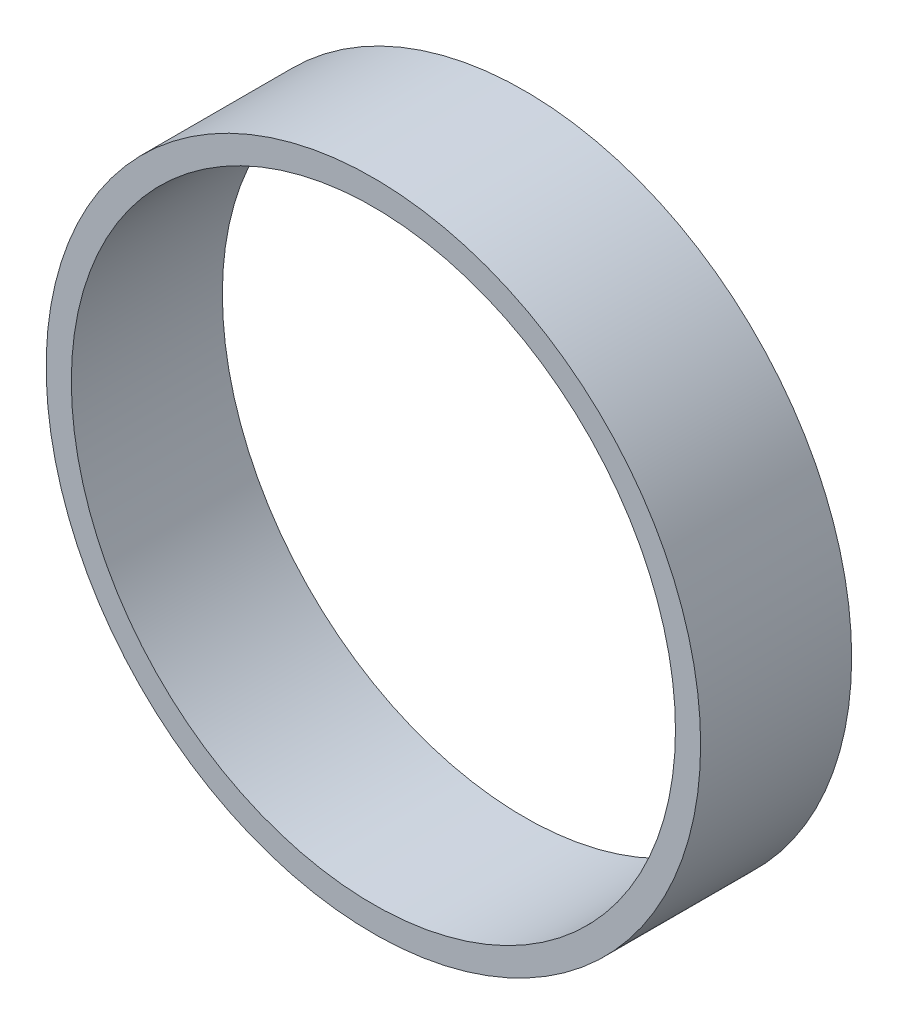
ISO-10303-21;
HEADER;
FILE_DESCRIPTION(('STEP AP214'),'2;1');
FILE_NAME('part.step','',(''),(''),'','','');
FILE_SCHEMA(('AUTOMOTIVE_DESIGN { 1 0 10303 214 1 1 1 1 }'));
ENDSEC;
DATA;
#1=APPLICATION_CONTEXT('core data for automotive mechanical design processes');
#2=APPLICATION_PROTOCOL_DEFINITION('international standard','automotive_design',2000,#1);
#3=PRODUCT_CONTEXT('',#1,'mechanical');
#4=PRODUCT('Part','Part','',(#3));
#5=PRODUCT_RELATED_PRODUCT_CATEGORY('part','',(#4));
#6=PRODUCT_DEFINITION_FORMATION('','',#4);
#7=PRODUCT_DEFINITION_CONTEXT('part definition',#1,'design');
#8=PRODUCT_DEFINITION('design','',#6,#7);
#9=PRODUCT_DEFINITION_SHAPE('','',#8);
#10=(LENGTH_UNIT() NAMED_UNIT(*) SI_UNIT(.MILLI.,.METRE.));
#11=(NAMED_UNIT(*) PLANE_ANGLE_UNIT() SI_UNIT($,.RADIAN.));
#12=(NAMED_UNIT(*) SI_UNIT($,.STERADIAN.) SOLID_ANGLE_UNIT());
#13=UNCERTAINTY_MEASURE_WITH_UNIT(LENGTH_MEASURE(1.E-05),#10,'distance_accuracy_value','');
#14=(GEOMETRIC_REPRESENTATION_CONTEXT(3) GLOBAL_UNCERTAINTY_ASSIGNED_CONTEXT((#13)) GLOBAL_UNIT_ASSIGNED_CONTEXT((#10,
#11,#12)) REPRESENTATION_CONTEXT('',''));
#15=CARTESIAN_POINT('',(0.,0.,0.));
#16=DIRECTION('',(0.,0.,1.));
#17=DIRECTION('',(1.,0.,0.));
#18=AXIS2_PLACEMENT_3D('',#15,#16,#17);
#19=CARTESIAN_POINT('',(0.,0.,15.));
#20=DIRECTION('',(0.,0.,1.));
#21=DIRECTION('',(1.,0.,0.));
#22=AXIS2_PLACEMENT_3D('',#19,#20,#21);
#23=PLANE('',#22);
#24=CARTESIAN_POINT('',(0.,0.,15.));
#25=DIRECTION('',(0.,0.,1.));
#26=DIRECTION('',(1.,0.,0.));
#27=AXIS2_PLACEMENT_3D('',#24,#25,#26);
#28=CIRCLE('',#27,32.5);
#29=CARTESIAN_POINT('',(32.5,0.,15.));
#30=VERTEX_POINT('',#29);
#31=EDGE_CURVE('E10',#30,#30,#28,.T.);
#32=ORIENTED_EDGE('',*,*,#31,.T.);
#33=EDGE_LOOP('',(#32));
#34=FACE_BOUND('',#33,.T.);
#35=CARTESIAN_POINT('',(0.,0.,15.));
#36=DIRECTION('',(0.,0.,1.));
#37=DIRECTION('',(1.,0.,0.));
#38=AXIS2_PLACEMENT_3D('',#35,#36,#37);
#39=CIRCLE('',#38,30.);
#40=CARTESIAN_POINT('',(30.,0.,15.));
#41=VERTEX_POINT('',#40);
#42=EDGE_CURVE('E40',#41,#41,#39,.T.);
#43=ORIENTED_EDGE('',*,*,#42,.F.);
#44=EDGE_LOOP('',(#43));
#45=FACE_BOUND('',#44,.T.);
#46=ADVANCED_FACE('F29',(#34,#45),#23,.T.);
#47=CARTESIAN_POINT('',(0.,0.,0.));
#48=DIRECTION('',(0.,0.,1.));
#49=DIRECTION('',(1.,0.,0.));
#50=AXIS2_PLACEMENT_3D('',#47,#48,#49);
#51=PLANE('',#50);
#52=CARTESIAN_POINT('',(0.,0.,0.));
#53=DIRECTION('',(0.,0.,1.));
#54=DIRECTION('',(1.,0.,0.));
#55=AXIS2_PLACEMENT_3D('',#52,#53,#54);
#56=CIRCLE('',#55,32.5);
#57=CARTESIAN_POINT('',(32.5,0.,0.));
#58=VERTEX_POINT('',#57);
#59=EDGE_CURVE('E33',#58,#58,#56,.T.);
#60=ORIENTED_EDGE('',*,*,#59,.F.);
#61=EDGE_LOOP('',(#60));
#62=FACE_BOUND('',#61,.T.);
#63=CARTESIAN_POINT('',(0.,0.,0.));
#64=DIRECTION('',(0.,0.,1.));
#65=DIRECTION('',(1.,0.,0.));
#66=AXIS2_PLACEMENT_3D('',#63,#64,#65);
#67=CIRCLE('',#66,30.);
#68=CARTESIAN_POINT('',(30.,0.,0.));
#69=VERTEX_POINT('',#68);
#70=EDGE_CURVE('E42',#69,#69,#67,.T.);
#71=ORIENTED_EDGE('',*,*,#70,.T.);
#72=EDGE_LOOP('',(#71));
#73=FACE_BOUND('',#72,.T.);
#74=ADVANCED_FACE('F52',(#62,#73),#51,.F.);
#75=CARTESIAN_POINT('',(0.,0.,15.));
#76=DIRECTION('',(0.,0.,-1.));
#77=DIRECTION('',(-1.,0.,0.));
#78=AXIS2_PLACEMENT_3D('',#75,#76,#77);
#79=CYLINDRICAL_SURFACE('',#78,32.5);
#80=ORIENTED_EDGE('',*,*,#31,.F.);
#81=EDGE_LOOP('',(#80));
#82=FACE_BOUND('',#81,.T.);
#83=ORIENTED_EDGE('',*,*,#59,.T.);
#84=EDGE_LOOP('',(#83));
#85=FACE_BOUND('',#84,.T.);
#86=ADVANCED_FACE('F31',(#82,#85),#79,.T.);
#87=CARTESIAN_POINT('',(0.,0.,15.));
#88=DIRECTION('',(0.,0.,-1.));
#89=DIRECTION('',(-1.,0.,0.));
#90=AXIS2_PLACEMENT_3D('',#87,#88,#89);
#91=CYLINDRICAL_SURFACE('',#90,30.);
#92=ORIENTED_EDGE('',*,*,#42,.T.);
#93=EDGE_LOOP('',(#92));
#94=FACE_BOUND('',#93,.T.);
#95=ORIENTED_EDGE('',*,*,#70,.F.);
#96=EDGE_LOOP('',(#95));
#97=FACE_BOUND('',#96,.T.);
#98=ADVANCED_FACE('F48',(#94,#97),#91,.F.);
#99=CLOSED_SHELL('',(#46,#74,#86,#98));
#100=MANIFOLD_SOLID_BREP('B2',#99);
#101=ADVANCED_BREP_SHAPE_REPRESENTATION('',(#18,#100),#14);
#102=SHAPE_DEFINITION_REPRESENTATION(#9,#101);
ENDSEC;
END-ISO-10303-21;
